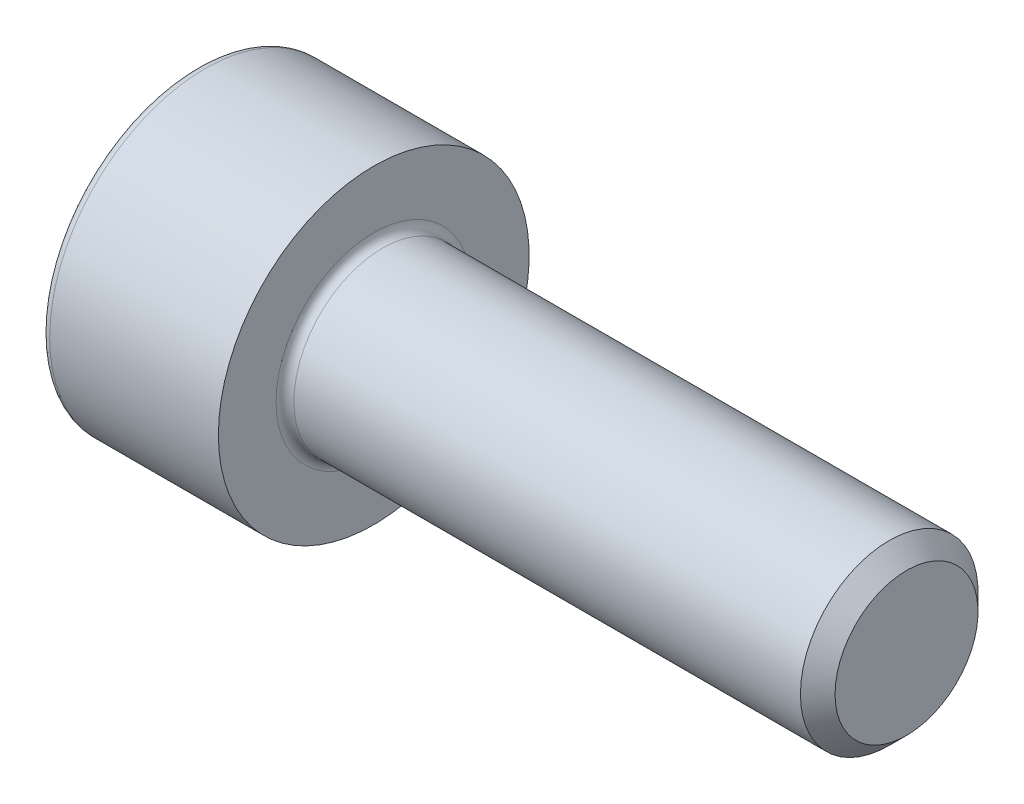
from build123d import *

# Parameters (mm, degrees)
FILLET1_R   = 0.2
FILLET2_R   = 0.2
HEX_2_DEPTH = 2


with BuildPart() as part:
    # BodySke → Base-Revolve (revolve)
    with BuildSketch(Plane.XY, mode=Mode.PRIVATE) as base_revolve_sk:
        Polygon((0, 0), (0, 3.5), (4, 3.5), (4, 2), (15.61, 2), (16, 1.61), (16, 0), align=None)
    revolve(base_revolve_sk.sketch.rotate(Axis((-31.75, 0, 0), (1, 0, 0)), 90), axis=Axis((-31.75, 0, 0), (1, 0, 0)))

    # Fillet1
    fillet1_edges = [part.edges().sort_by_distance(p)[0] for p in [
        (4, 0, -2),
    ]]
    fillet(fillet1_edges, radius=FILLET1_R)

    # Fillet2
    fillet2_edges = [part.edges().sort_by_distance(p)[0] for p in [
        (0, 0, -3.5),
    ]]
    fillet(fillet2_edges, radius=FILLET2_R)

    # Sketch2 → Hex-PreBroach (revolve, cut)
    with BuildSketch(Plane.XY, mode=Mode.PRIVATE) as hex_prebroach_sk:
        Polygon((0, 1.5355), (2, 1.5355), (2.886521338, 0), (0, 0), align=None)
    revolve(hex_prebroach_sk.sketch.rotate(Axis((0, 0, 0), (1, 0, 0)), 90), axis=Axis((0, 0, 0), (1, 0, 0)), mode=Mode.SUBTRACT)

    # Sketch3 → Hex 2 (cut)
    with BuildSketch(Plane(origin=(0, 0, 0), x_dir=(0, 0.500000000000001, 0.866025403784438), z_dir=(-1, 0, 0))):
        Polygon((0.886521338, 1.5355), (-0.886521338, 1.5355), (-1.773042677, 0), (-0.886521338, -1.5355), (0.886521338, -1.5355), (1.773042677, 0), align=None)
    extrude(amount=-HEX_2_DEPTH, mode=Mode.SUBTRACT)


solid = part.part
